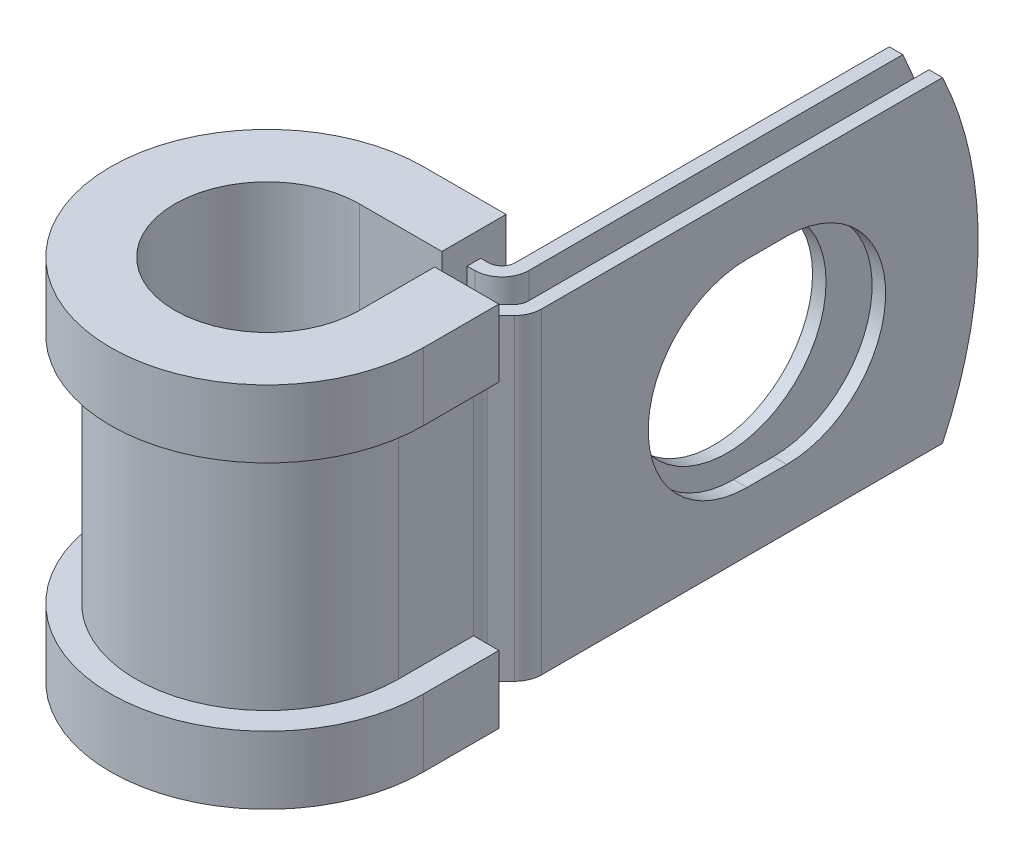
ISO-10303-21;
HEADER;
FILE_DESCRIPTION(('STEP AP214'),'2;1');
FILE_NAME('part.step','',(''),(''),'','','');
FILE_SCHEMA(('AUTOMOTIVE_DESIGN { 1 0 10303 214 1 1 1 1 }'));
ENDSEC;
DATA;
#1=APPLICATION_CONTEXT('core data for automotive mechanical design processes');
#2=APPLICATION_PROTOCOL_DEFINITION('international standard','automotive_design',2000,#1);
#3=PRODUCT_CONTEXT('',#1,'mechanical');
#4=PRODUCT('Part','Part','',(#3));
#5=PRODUCT_RELATED_PRODUCT_CATEGORY('part','',(#4));
#6=PRODUCT_DEFINITION_FORMATION('','',#4);
#7=PRODUCT_DEFINITION_CONTEXT('part definition',#1,'design');
#8=PRODUCT_DEFINITION('design','',#6,#7);
#9=PRODUCT_DEFINITION_SHAPE('','',#8);
#10=(LENGTH_UNIT() NAMED_UNIT(*) SI_UNIT(.MILLI.,.METRE.));
#11=(NAMED_UNIT(*) PLANE_ANGLE_UNIT() SI_UNIT($,.RADIAN.));
#12=(NAMED_UNIT(*) SI_UNIT($,.STERADIAN.) SOLID_ANGLE_UNIT());
#13=UNCERTAINTY_MEASURE_WITH_UNIT(LENGTH_MEASURE(1.E-05),#10,'distance_accuracy_value','');
#14=(GEOMETRIC_REPRESENTATION_CONTEXT(3) GLOBAL_UNCERTAINTY_ASSIGNED_CONTEXT((#13)) GLOBAL_UNIT_ASSIGNED_CONTEXT((#10,
#11,#12)) REPRESENTATION_CONTEXT('',''));
#15=CARTESIAN_POINT('',(0.,0.,0.));
#16=DIRECTION('',(0.,0.,1.));
#17=DIRECTION('',(1.,0.,0.));
#18=AXIS2_PLACEMENT_3D('',#15,#16,#17);
#19=CARTESIAN_POINT('',(7.80147438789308,-9.525,-7.0739));
#20=DIRECTION('',(0.,1.,0.));
#21=DIRECTION('',(1.,0.,0.));
#22=AXIS2_PLACEMENT_3D('',#19,#20,#21);
#23=PLANE('',#22);
#24=DIRECTION('',(0.,0.,-1.));
#25=VECTOR('',#24,1.);
#26=CARTESIAN_POINT('',(4.95667438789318,-9.525,-7.0739));
#27=LINE('',#26,#25);
#28=CARTESIAN_POINT('',(4.95667438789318,-9.525,-7.0739));
#29=VERTEX_POINT('',#28);
#30=CARTESIAN_POINT('',(4.95667438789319,-9.525,-7.8867));
#31=VERTEX_POINT('',#30);
#32=EDGE_CURVE('E505',#29,#31,#27,.T.);
#33=ORIENTED_EDGE('',*,*,#32,.T.);
#34=DIRECTION('',(-1.,0.,0.));
#35=VECTOR('',#34,1.);
#36=CARTESIAN_POINT('',(0.,-9.525,-7.8867));
#37=LINE('',#36,#35);
#38=CARTESIAN_POINT('',(5.41387438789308,-9.525,-7.8867));
#39=VERTEX_POINT('',#38);
#40=EDGE_CURVE('E392',#39,#31,#37,.T.);
#41=ORIENTED_EDGE('',*,*,#40,.F.);
#42=CARTESIAN_POINT('',(5.41387438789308,-9.525,-8.6995));
#43=DIRECTION('',(0.,1.,0.));
#44=DIRECTION('',(1.,0.,0.));
#45=AXIS2_PLACEMENT_3D('',#42,#43,#44);
#46=CIRCLE('',#45,0.8128);
#47=CARTESIAN_POINT('',(6.22667438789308,-9.525,-8.6995));
#48=VERTEX_POINT('',#47);
#49=EDGE_CURVE('E390',#48,#39,#46,.F.);
#50=ORIENTED_EDGE('',*,*,#49,.F.);
#51=DIRECTION('',(0.,0.,-1.));
#52=VECTOR('',#51,1.);
#53=CARTESIAN_POINT('',(6.22667438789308,-9.525,-33.3248));
#54=LINE('',#53,#52);
#55=CARTESIAN_POINT('',(6.22667438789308,-9.525,-31.1802631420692));
#56=VERTEX_POINT('',#55);
#57=EDGE_CURVE('E388',#56,#48,#54,.F.);
#58=ORIENTED_EDGE('',*,*,#57,.F.);
#59=DIRECTION('',(-1.,0.,0.));
#60=VECTOR('',#59,1.);
#61=CARTESIAN_POINT('',(9.42707438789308,-9.525,-31.1802631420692));
#62=LINE('',#61,#60);
#63=CARTESIAN_POINT('',(7.03947438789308,-9.525,-31.1802631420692));
#64=VERTEX_POINT('',#63);
#65=EDGE_CURVE('E11',#64,#56,#62,.T.);
#66=ORIENTED_EDGE('',*,*,#65,.F.);
#67=DIRECTION('',(0.,0.,1.));
#68=VECTOR('',#67,1.);
#69=CARTESIAN_POINT('',(7.03947438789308,-9.525,-33.3248));
#70=LINE('',#69,#68);
#71=CARTESIAN_POINT('',(7.03947438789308,-9.525,-8.6995));
#72=VERTEX_POINT('',#71);
#73=EDGE_CURVE('E386',#64,#72,#70,.T.);
#74=ORIENTED_EDGE('',*,*,#73,.T.);
#75=CARTESIAN_POINT('',(5.41387438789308,-9.525,-8.6995));
#76=DIRECTION('',(0.,-1.,0.));
#77=DIRECTION('',(0.,0.,1.));
#78=AXIS2_PLACEMENT_3D('',#75,#76,#77);
#79=CIRCLE('',#78,1.6256);
#80=CARTESIAN_POINT('',(5.41387438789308,-9.525,-7.0739));
#81=VERTEX_POINT('',#80);
#82=EDGE_CURVE('E383',#72,#81,#79,.T.);
#83=ORIENTED_EDGE('',*,*,#82,.T.);
#84=DIRECTION('',(-1.,0.,0.));
#85=VECTOR('',#84,1.);
#86=CARTESIAN_POINT('',(0.,-9.525,-7.0739));
#87=LINE('',#86,#85);
#88=EDGE_CURVE('E380',#81,#29,#87,.T.);
#89=ORIENTED_EDGE('',*,*,#88,.T.);
#90=EDGE_LOOP('',(#33,#41,#50,#58,#66,#74,#83,#89));
#91=FACE_BOUND('',#90,.T.);
#92=ADVANCED_FACE('F36',(#91),#23,.F.);
#93=CARTESIAN_POINT('',(7.80147438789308,9.525,-7.0739));
#94=DIRECTION('',(0.,1.,0.));
#95=DIRECTION('',(1.,0.,0.));
#96=AXIS2_PLACEMENT_3D('',#93,#94,#95);
#97=PLANE('',#96);
#98=DIRECTION('',(-1.,0.,0.));
#99=VECTOR('',#98,1.);
#100=CARTESIAN_POINT('',(0.,9.525,-7.8867));
#101=LINE('',#100,#99);
#102=CARTESIAN_POINT('',(5.41387438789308,9.525,-7.8867));
#103=VERTEX_POINT('',#102);
#104=CARTESIAN_POINT('',(4.95667438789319,9.525,-7.8867));
#105=VERTEX_POINT('',#104);
#106=EDGE_CURVE('E350',#103,#105,#101,.T.);
#107=ORIENTED_EDGE('',*,*,#106,.T.);
#108=DIRECTION('',(0.,0.,1.));
#109=VECTOR('',#108,1.);
#110=CARTESIAN_POINT('',(4.95667438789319,9.525,-7.8867));
#111=LINE('',#110,#109);
#112=CARTESIAN_POINT('',(4.95667438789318,9.525,-7.0739));
#113=VERTEX_POINT('',#112);
#114=EDGE_CURVE('E499',#105,#113,#111,.T.);
#115=ORIENTED_EDGE('',*,*,#114,.T.);
#116=DIRECTION('',(-1.,0.,0.));
#117=VECTOR('',#116,1.);
#118=CARTESIAN_POINT('',(0.,9.525,-7.0739));
#119=LINE('',#118,#117);
#120=CARTESIAN_POINT('',(5.41387438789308,9.525,-7.0739));
#121=VERTEX_POINT('',#120);
#122=EDGE_CURVE('E607',#121,#113,#119,.T.);
#123=ORIENTED_EDGE('',*,*,#122,.F.);
#124=CARTESIAN_POINT('',(5.41387438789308,9.525,-8.6995));
#125=DIRECTION('',(0.,-1.,0.));
#126=DIRECTION('',(0.,0.,1.));
#127=AXIS2_PLACEMENT_3D('',#124,#125,#126);
#128=CIRCLE('',#127,1.6256);
#129=CARTESIAN_POINT('',(7.03947438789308,9.525,-8.6995));
#130=VERTEX_POINT('',#129);
#131=EDGE_CURVE('E352',#130,#121,#128,.T.);
#132=ORIENTED_EDGE('',*,*,#131,.F.);
#133=DIRECTION('',(0.,0.,1.));
#134=VECTOR('',#133,1.);
#135=CARTESIAN_POINT('',(7.03947438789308,9.525,-33.3248));
#136=LINE('',#135,#134);
#137=CARTESIAN_POINT('',(7.03947438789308,9.525,-31.1802631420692));
#138=VERTEX_POINT('',#137);
#139=EDGE_CURVE('E343',#138,#130,#136,.T.);
#140=ORIENTED_EDGE('',*,*,#139,.F.);
#141=DIRECTION('',(-1.,0.,0.));
#142=VECTOR('',#141,1.);
#143=CARTESIAN_POINT('',(9.42707438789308,9.525,-31.1802631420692));
#144=LINE('',#143,#142);
#145=CARTESIAN_POINT('',(6.22667438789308,9.525,-31.1802631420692));
#146=VERTEX_POINT('',#145);
#147=EDGE_CURVE('E44',#138,#146,#144,.T.);
#148=ORIENTED_EDGE('',*,*,#147,.T.);
#149=DIRECTION('',(0.,0.,-1.));
#150=VECTOR('',#149,1.);
#151=CARTESIAN_POINT('',(6.22667438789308,9.525,-33.3248));
#152=LINE('',#151,#150);
#153=CARTESIAN_POINT('',(6.22667438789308,9.525,-8.6995));
#154=VERTEX_POINT('',#153);
#155=EDGE_CURVE('E340',#146,#154,#152,.F.);
#156=ORIENTED_EDGE('',*,*,#155,.T.);
#157=CARTESIAN_POINT('',(5.41387438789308,9.525,-8.6995));
#158=DIRECTION('',(0.,1.,0.));
#159=DIRECTION('',(1.,0.,0.));
#160=AXIS2_PLACEMENT_3D('',#157,#158,#159);
#161=CIRCLE('',#160,0.8128);
#162=EDGE_CURVE('E348',#154,#103,#161,.F.);
#163=ORIENTED_EDGE('',*,*,#162,.T.);
#164=EDGE_LOOP('',(#107,#115,#123,#132,#140,#148,#156,#163));
#165=FACE_BOUND('',#164,.T.);
#166=ADVANCED_FACE('F339',(#165),#97,.T.);
#167=CARTESIAN_POINT('',(0.,9.525,-7.0739));
#168=DIRECTION('',(0.,0.,1.));
#169=DIRECTION('',(1.,0.,0.));
#170=AXIS2_PLACEMENT_3D('',#167,#168,#169);
#171=PLANE('',#170);
#172=ORIENTED_EDGE('',*,*,#122,.T.);
#173=DIRECTION('',(0.,-1.,0.));
#174=VECTOR('',#173,1.);
#175=CARTESIAN_POINT('',(4.95667438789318,9.525,-7.0739));
#176=LINE('',#175,#174);
#177=EDGE_CURVE('E502',#113,#29,#176,.T.);
#178=ORIENTED_EDGE('',*,*,#177,.T.);
#179=ORIENTED_EDGE('',*,*,#88,.F.);
#180=DIRECTION('',(0.,-1.,0.));
#181=VECTOR('',#180,1.);
#182=CARTESIAN_POINT('',(5.41387438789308,9.525,-7.0739));
#183=LINE('',#182,#181);
#184=EDGE_CURVE('E326',#121,#81,#183,.T.);
#185=ORIENTED_EDGE('',*,*,#184,.F.);
#186=EDGE_LOOP('',(#172,#178,#179,#185));
#187=FACE_BOUND('',#186,.T.);
#188=ADVANCED_FACE('F617',(#187),#171,.T.);
#189=CARTESIAN_POINT('',(9.42707438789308,9.525,-7.0739));
#190=DIRECTION('',(-1.,0.,0.));
#191=DIRECTION('',(0.,0.,1.));
#192=AXIS2_PLACEMENT_3D('',#189,#190,#191);
#193=PLANE('',#192);
#194=CARTESIAN_POINT('',(9.42707438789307,0.,-21.8185999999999));
#195=DIRECTION('',(1.,0.,0.));
#196=DIRECTION('',(0.,0.,-1.));
#197=AXIS2_PLACEMENT_3D('',#194,#195,#196);
#198=CIRCLE('',#197,5.9436);
#199=CARTESIAN_POINT('',(9.42707438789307,-5.9436,-21.8186000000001));
#200=VERTEX_POINT('',#199);
#201=CARTESIAN_POINT('',(9.42707438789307,5.9436,-21.8186000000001));
#202=VERTEX_POINT('',#201);
#203=EDGE_CURVE('E562',#200,#202,#198,.T.);
#204=ORIENTED_EDGE('',*,*,#203,.F.);
#205=DIRECTION('',(0.,0.,-1.));
#206=VECTOR('',#205,1.);
#207=CARTESIAN_POINT('',(9.42707438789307,-5.9436,-19.4309999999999));
#208=LINE('',#207,#206);
#209=CARTESIAN_POINT('',(9.42707438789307,-5.9436,-19.4309999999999));
#210=VERTEX_POINT('',#209);
#211=EDGE_CURVE('E565',#210,#200,#208,.T.);
#212=ORIENTED_EDGE('',*,*,#211,.F.);
#213=CARTESIAN_POINT('',(9.42707438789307,0.,-19.4309999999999));
#214=DIRECTION('',(1.,0.,0.));
#215=DIRECTION('',(0.,0.,-1.));
#216=AXIS2_PLACEMENT_3D('',#213,#214,#215);
#217=CIRCLE('',#216,5.9436);
#218=CARTESIAN_POINT('',(9.42707438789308,5.9436,-19.4309999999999));
#219=VERTEX_POINT('',#218);
#220=EDGE_CURVE('E558',#219,#210,#217,.T.);
#221=ORIENTED_EDGE('',*,*,#220,.F.);
#222=DIRECTION('',(0.,0.,1.));
#223=VECTOR('',#222,1.);
#224=CARTESIAN_POINT('',(9.42707438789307,5.9436,-19.4309999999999));
#225=LINE('',#224,#223);
#226=EDGE_CURVE('E559',#202,#219,#225,.T.);
#227=ORIENTED_EDGE('',*,*,#226,.F.);
#228=EDGE_LOOP('',(#204,#212,#221,#227));
#229=FACE_BOUND('',#228,.T.);
#230=DIRECTION('',(0.,0.,-1.));
#231=VECTOR('',#230,1.);
#232=CARTESIAN_POINT('',(9.42707438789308,-9.525,-7.0739));
#233=LINE('',#232,#231);
#234=CARTESIAN_POINT('',(9.42707438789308,-9.525,-7.0739));
#235=VERTEX_POINT('',#234);
#236=CARTESIAN_POINT('',(9.42707438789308,-9.525,-31.1802631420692));
#237=VERTEX_POINT('',#236);
#238=EDGE_CURVE('E364',#235,#237,#233,.T.);
#239=ORIENTED_EDGE('',*,*,#238,.T.);
#240=CARTESIAN_POINT('',(9.42707438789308,0.,-11.0998));
#241=DIRECTION('',(-1.,0.,0.));
#242=DIRECTION('',(0.,0.,1.));
#243=AXIS2_PLACEMENT_3D('',#240,#241,#242);
#244=CIRCLE('',#243,22.225);
#245=CARTESIAN_POINT('',(9.42707438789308,9.525,-31.1802631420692));
#246=VERTEX_POINT('',#245);
#247=EDGE_CURVE('E550',#246,#237,#244,.T.);
#248=ORIENTED_EDGE('',*,*,#247,.F.);
#249=DIRECTION('',(0.,0.,-1.));
#250=VECTOR('',#249,1.);
#251=CARTESIAN_POINT('',(9.42707438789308,9.525,-7.0739));
#252=LINE('',#251,#250);
#253=CARTESIAN_POINT('',(9.42707438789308,9.525,-7.0739));
#254=VERTEX_POINT('',#253);
#255=EDGE_CURVE('E401',#254,#246,#252,.T.);
#256=ORIENTED_EDGE('',*,*,#255,.F.);
#257=DIRECTION('',(0.,-1.,0.));
#258=VECTOR('',#257,1.);
#259=CARTESIAN_POINT('',(9.42707438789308,9.525,-7.0739));
#260=LINE('',#259,#258);
#261=EDGE_CURVE('E363',#254,#235,#260,.T.);
#262=ORIENTED_EDGE('',*,*,#261,.T.);
#263=EDGE_LOOP('',(#239,#248,#256,#262));
#264=FACE_BOUND('',#263,.T.);
#265=ADVANCED_FACE('F38',(#229,#264),#193,.F.);
#266=CARTESIAN_POINT('',(8.61427438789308,9.525,-7.0739));
#267=DIRECTION('',(-1.,0.,0.));
#268=DIRECTION('',(0.,0.,1.));
#269=AXIS2_PLACEMENT_3D('',#266,#267,#268);
#270=PLANE('',#269);
#271=DIRECTION('',(0.,0.,-1.));
#272=VECTOR('',#271,1.);
#273=CARTESIAN_POINT('',(8.61427438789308,-5.9436,-19.4309999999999));
#274=LINE('',#273,#272);
#275=CARTESIAN_POINT('',(8.61427438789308,-5.9436,-19.4309999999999));
#276=VERTEX_POINT('',#275);
#277=CARTESIAN_POINT('',(8.61427438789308,-5.9436,-21.8186000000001));
#278=VERTEX_POINT('',#277);
#279=EDGE_CURVE('E561',#276,#278,#274,.T.);
#280=ORIENTED_EDGE('',*,*,#279,.T.);
#281=CARTESIAN_POINT('',(8.61427438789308,0.,-21.8185999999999));
#282=DIRECTION('',(-1.,0.,0.));
#283=DIRECTION('',(0.,0.,1.));
#284=AXIS2_PLACEMENT_3D('',#281,#282,#283);
#285=CIRCLE('',#284,5.9436);
#286=CARTESIAN_POINT('',(8.61427438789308,5.9436,-21.8186000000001));
#287=VERTEX_POINT('',#286);
#288=EDGE_CURVE('E582',#278,#287,#285,.F.);
#289=ORIENTED_EDGE('',*,*,#288,.T.);
#290=DIRECTION('',(0.,0.,1.));
#291=VECTOR('',#290,1.);
#292=CARTESIAN_POINT('',(8.61427438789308,5.9436,-19.4309999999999));
#293=LINE('',#292,#291);
#294=CARTESIAN_POINT('',(8.61427438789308,5.9436,-19.4309999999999));
#295=VERTEX_POINT('',#294);
#296=EDGE_CURVE('E578',#287,#295,#293,.T.);
#297=ORIENTED_EDGE('',*,*,#296,.T.);
#298=CARTESIAN_POINT('',(8.61427438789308,0.,-19.4309999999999));
#299=DIRECTION('',(-1.,0.,0.));
#300=DIRECTION('',(0.,0.,1.));
#301=AXIS2_PLACEMENT_3D('',#298,#299,#300);
#302=CIRCLE('',#301,5.9436);
#303=EDGE_CURVE('E573',#295,#276,#302,.F.);
#304=ORIENTED_EDGE('',*,*,#303,.T.);
#305=EDGE_LOOP('',(#280,#289,#297,#304));
#306=FACE_BOUND('',#305,.T.);
#307=CARTESIAN_POINT('',(8.61427438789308,0.,-11.0998));
#308=DIRECTION('',(-1.,0.,0.));
#309=DIRECTION('',(0.,0.,1.));
#310=AXIS2_PLACEMENT_3D('',#307,#308,#309);
#311=CIRCLE('',#310,22.225);
#312=CARTESIAN_POINT('',(8.61427438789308,9.525,-31.1802631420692));
#313=VERTEX_POINT('',#312);
#314=CARTESIAN_POINT('',(8.61427438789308,-9.525,-31.1802631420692));
#315=VERTEX_POINT('',#314);
#316=EDGE_CURVE('E58',#313,#315,#311,.T.);
#317=ORIENTED_EDGE('',*,*,#316,.T.);
#318=DIRECTION('',(0.,0.,-1.));
#319=VECTOR('',#318,1.);
#320=CARTESIAN_POINT('',(8.61427438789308,-9.525,-7.0739));
#321=LINE('',#320,#319);
#322=CARTESIAN_POINT('',(8.61427438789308,-9.525,-7.0739));
#323=VERTEX_POINT('',#322);
#324=EDGE_CURVE('E367',#323,#315,#321,.T.);
#325=ORIENTED_EDGE('',*,*,#324,.F.);
#326=DIRECTION('',(0.,-1.,0.));
#327=VECTOR('',#326,1.);
#328=CARTESIAN_POINT('',(8.61427438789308,9.525,-7.0739));
#329=LINE('',#328,#327);
#330=CARTESIAN_POINT('',(8.61427438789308,9.525,-7.0739));
#331=VERTEX_POINT('',#330);
#332=EDGE_CURVE('E334',#331,#323,#329,.T.);
#333=ORIENTED_EDGE('',*,*,#332,.F.);
#334=DIRECTION('',(0.,0.,-1.));
#335=VECTOR('',#334,1.);
#336=CARTESIAN_POINT('',(8.61427438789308,9.525,-7.0739));
#337=LINE('',#336,#335);
#338=EDGE_CURVE('E597',#331,#313,#337,.T.);
#339=ORIENTED_EDGE('',*,*,#338,.T.);
#340=EDGE_LOOP('',(#317,#325,#333,#339));
#341=FACE_BOUND('',#340,.T.);
#342=ADVANCED_FACE('F671',(#306,#341),#270,.T.);
#343=CARTESIAN_POINT('',(7.03947438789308,9.525,-33.3248));
#344=DIRECTION('',(1.,0.,0.));
#345=DIRECTION('',(0.,0.,-1.));
#346=AXIS2_PLACEMENT_3D('',#343,#344,#345);
#347=PLANE('',#346);
#348=CARTESIAN_POINT('',(7.03947438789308,0.,-20.6248));
#349=DIRECTION('',(1.,0.,0.));
#350=DIRECTION('',(0.,0.,-1.));
#351=AXIS2_PLACEMENT_3D('',#348,#349,#350);
#352=CIRCLE('',#351,5.9436);
#353=CARTESIAN_POINT('',(7.03947438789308,0.,-26.5684));
#354=VERTEX_POINT('',#353);
#355=EDGE_CURVE('E368',#354,#354,#352,.F.);
#356=ORIENTED_EDGE('',*,*,#355,.T.);
#357=EDGE_LOOP('',(#356));
#358=FACE_BOUND('',#357,.T.);
#359=ORIENTED_EDGE('',*,*,#73,.F.);
#360=CARTESIAN_POINT('',(7.03947438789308,0.,-11.0998));
#361=DIRECTION('',(1.,0.,0.));
#362=DIRECTION('',(0.,0.,-1.));
#363=AXIS2_PLACEMENT_3D('',#360,#361,#362);
#364=CIRCLE('',#363,22.225);
#365=EDGE_CURVE('E555',#64,#138,#364,.T.);
#366=ORIENTED_EDGE('',*,*,#365,.T.);
#367=ORIENTED_EDGE('',*,*,#139,.T.);
#368=DIRECTION('',(0.,-1.,0.));
#369=VECTOR('',#368,1.);
#370=CARTESIAN_POINT('',(7.03947438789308,9.525,-8.6995));
#371=LINE('',#370,#369);
#372=EDGE_CURVE('E323',#130,#72,#371,.T.);
#373=ORIENTED_EDGE('',*,*,#372,.T.);
#374=EDGE_LOOP('',(#359,#366,#367,#373));
#375=FACE_BOUND('',#374,.T.);
#376=ADVANCED_FACE('F623',(#358,#375),#347,.T.);
#377=CARTESIAN_POINT('',(6.22667438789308,9.525,-33.3248));
#378=DIRECTION('',(1.,0.,0.));
#379=DIRECTION('',(0.,0.,-1.));
#380=AXIS2_PLACEMENT_3D('',#377,#378,#379);
#381=PLANE('',#380);
#382=CARTESIAN_POINT('',(6.22667438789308,0.,-20.6248));
#383=DIRECTION('',(-1.,0.,0.));
#384=DIRECTION('',(0.,0.,1.));
#385=AXIS2_PLACEMENT_3D('',#382,#383,#384);
#386=CIRCLE('',#385,5.9436);
#387=CARTESIAN_POINT('',(6.22667438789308,0.,-14.6812));
#388=VERTEX_POINT('',#387);
#389=EDGE_CURVE('E590',#388,#388,#386,.T.);
#390=ORIENTED_EDGE('',*,*,#389,.F.);
#391=EDGE_LOOP('',(#390));
#392=FACE_BOUND('',#391,.T.);
#393=CARTESIAN_POINT('',(6.22667438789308,0.,-11.0998));
#394=DIRECTION('',(-1.,0.,0.));
#395=DIRECTION('',(0.,0.,1.));
#396=AXIS2_PLACEMENT_3D('',#393,#394,#395);
#397=CIRCLE('',#396,22.225);
#398=EDGE_CURVE('E50',#146,#56,#397,.T.);
#399=ORIENTED_EDGE('',*,*,#398,.T.);
#400=ORIENTED_EDGE('',*,*,#57,.T.);
#401=DIRECTION('',(0.,-1.,0.));
#402=VECTOR('',#401,1.);
#403=CARTESIAN_POINT('',(6.22667438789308,9.525,-8.6995));
#404=LINE('',#403,#402);
#405=EDGE_CURVE('E320',#154,#48,#404,.T.);
#406=ORIENTED_EDGE('',*,*,#405,.F.);
#407=ORIENTED_EDGE('',*,*,#155,.F.);
#408=EDGE_LOOP('',(#399,#400,#406,#407));
#409=FACE_BOUND('',#408,.T.);
#410=ADVANCED_FACE('F346',(#392,#409),#381,.F.);
#411=CARTESIAN_POINT('',(8.6995,-9.525,-4.52350726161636));
#412=DIRECTION('',(0.,1.,0.));
#413=DIRECTION('',(1.,0.,0.));
#414=AXIS2_PLACEMENT_3D('',#411,#412,#413);
#415=CIRCLE('',#414,0.812799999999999);
#416=CARTESIAN_POINT('',(7.8867,-9.525,-4.52350726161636));
#417=VERTEX_POINT('',#416);
#418=CARTESIAN_POINT('',(8.12476360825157,-9.525,-5.09824365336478));
#419=VERTEX_POINT('',#418);
#420=EDGE_CURVE('E395',#417,#419,#415,.F.);
#421=ORIENTED_EDGE('',*,*,#420,.F.);
#422=DIRECTION('',(1.,0.,0.));
#423=VECTOR('',#422,1.);
#424=CARTESIAN_POINT('',(7.0739,-9.525,-4.52350726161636));
#425=LINE('',#424,#423);
#426=CARTESIAN_POINT('',(7.0739,-9.525,-4.52350726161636));
#427=VERTEX_POINT('',#426);
#428=EDGE_CURVE('E433',#427,#417,#425,.T.);
#429=ORIENTED_EDGE('',*,*,#428,.F.);
#430=CARTESIAN_POINT('',(8.6995,-9.525,-4.52350726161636));
#431=DIRECTION('',(0.,-1.,0.));
#432=DIRECTION('',(0.,0.,1.));
#433=AXIS2_PLACEMENT_3D('',#430,#431,#432);
#434=CIRCLE('',#433,1.6256);
#435=CARTESIAN_POINT('',(7.55002721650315,-9.525,-5.67298004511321));
#436=VERTEX_POINT('',#435);
#437=EDGE_CURVE('E377',#427,#436,#434,.T.);
#438=ORIENTED_EDGE('',*,*,#437,.T.);
#439=DIRECTION('',(0.707106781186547,0.,-0.707106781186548));
#440=VECTOR('',#439,1.);
#441=CARTESIAN_POINT('',(7.55002721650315,-9.525,-5.67298004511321));
#442=LINE('',#441,#440);
#443=CARTESIAN_POINT('',(8.37621077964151,-9.525,-6.49916360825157));
#444=VERTEX_POINT('',#443);
#445=EDGE_CURVE('E374',#436,#444,#442,.T.);
#446=ORIENTED_EDGE('',*,*,#445,.T.);
#447=CARTESIAN_POINT('',(7.80147438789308,-9.525,-7.0739));
#448=DIRECTION('',(0.,1.,0.));
#449=DIRECTION('',(0.,0.,1.));
#450=AXIS2_PLACEMENT_3D('',#447,#448,#449);
#451=CIRCLE('',#450,0.812800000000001);
#452=EDGE_CURVE('E371',#444,#323,#451,.T.);
#453=ORIENTED_EDGE('',*,*,#452,.T.);
#454=ORIENTED_EDGE('',*,*,#324,.T.);
#455=DIRECTION('',(-1.,0.,0.));
#456=VECTOR('',#455,1.);
#457=CARTESIAN_POINT('',(9.42707438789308,-9.525,-31.1802631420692));
#458=LINE('',#457,#456);
#459=EDGE_CURVE('E548',#237,#315,#458,.T.);
#460=ORIENTED_EDGE('',*,*,#459,.F.);
#461=ORIENTED_EDGE('',*,*,#238,.F.);
#462=CARTESIAN_POINT('',(7.80147438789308,-9.525,-7.0739));
#463=DIRECTION('',(0.,1.,0.));
#464=DIRECTION('',(1.,0.,0.));
#465=AXIS2_PLACEMENT_3D('',#462,#463,#464);
#466=CIRCLE('',#465,1.6256);
#467=CARTESIAN_POINT('',(8.95094717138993,-9.525,-5.92442721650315));
#468=VERTEX_POINT('',#467);
#469=EDGE_CURVE('E399',#468,#235,#466,.T.);
#470=ORIENTED_EDGE('',*,*,#469,.F.);
#471=DIRECTION('',(0.707106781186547,0.,-0.707106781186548));
#472=VECTOR('',#471,1.);
#473=CARTESIAN_POINT('',(8.12476360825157,-9.525,-5.09824365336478));
#474=LINE('',#473,#472);
#475=EDGE_CURVE('E397',#419,#468,#474,.T.);
#476=ORIENTED_EDGE('',*,*,#475,.F.);
#477=EDGE_LOOP('',(#421,#429,#438,#446,#453,#454,#460,#461,#470,#476));
#478=FACE_BOUND('',#477,.T.);
#479=ADVANCED_FACE('F657',(#478),#23,.F.);
#480=DIRECTION('',(-1.,0.,0.));
#481=VECTOR('',#480,1.);
#482=CARTESIAN_POINT('',(7.8867,9.525,-4.52350726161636));
#483=LINE('',#482,#481);
#484=CARTESIAN_POINT('',(7.8867,9.525,-4.52350726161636));
#485=VERTEX_POINT('',#484);
#486=CARTESIAN_POINT('',(7.0739,9.525,-4.52350726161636));
#487=VERTEX_POINT('',#486);
#488=EDGE_CURVE('E422',#485,#487,#483,.T.);
#489=ORIENTED_EDGE('',*,*,#488,.F.);
#490=CARTESIAN_POINT('',(8.6995,9.525,-4.52350726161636));
#491=DIRECTION('',(0.,1.,0.));
#492=DIRECTION('',(1.,0.,0.));
#493=AXIS2_PLACEMENT_3D('',#490,#491,#492);
#494=CIRCLE('',#493,0.812799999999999);
#495=CARTESIAN_POINT('',(8.12476360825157,9.525,-5.09824365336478));
#496=VERTEX_POINT('',#495);
#497=EDGE_CURVE('E357',#485,#496,#494,.F.);
#498=ORIENTED_EDGE('',*,*,#497,.T.);
#499=DIRECTION('',(0.707106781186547,0.,-0.707106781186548));
#500=VECTOR('',#499,1.);
#501=CARTESIAN_POINT('',(8.12476360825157,9.525,-5.09824365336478));
#502=LINE('',#501,#500);
#503=CARTESIAN_POINT('',(8.95094717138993,9.525,-5.92442721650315));
#504=VERTEX_POINT('',#503);
#505=EDGE_CURVE('E359',#496,#504,#502,.T.);
#506=ORIENTED_EDGE('',*,*,#505,.T.);
#507=CARTESIAN_POINT('',(7.80147438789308,9.525,-7.0739));
#508=DIRECTION('',(0.,1.,0.));
#509=DIRECTION('',(1.,0.,0.));
#510=AXIS2_PLACEMENT_3D('',#507,#508,#509);
#511=CIRCLE('',#510,1.6256);
#512=EDGE_CURVE('E361',#504,#254,#511,.T.);
#513=ORIENTED_EDGE('',*,*,#512,.T.);
#514=ORIENTED_EDGE('',*,*,#255,.T.);
#515=DIRECTION('',(-1.,0.,0.));
#516=VECTOR('',#515,1.);
#517=CARTESIAN_POINT('',(9.42707438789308,9.525,-31.1802631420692));
#518=LINE('',#517,#516);
#519=EDGE_CURVE('E552',#246,#313,#518,.T.);
#520=ORIENTED_EDGE('',*,*,#519,.T.);
#521=ORIENTED_EDGE('',*,*,#338,.F.);
#522=CARTESIAN_POINT('',(7.80147438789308,9.525,-7.0739));
#523=DIRECTION('',(0.,1.,0.));
#524=DIRECTION('',(0.,0.,1.));
#525=AXIS2_PLACEMENT_3D('',#522,#523,#524);
#526=CIRCLE('',#525,0.812800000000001);
#527=CARTESIAN_POINT('',(8.37621077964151,9.525,-6.49916360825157));
#528=VERTEX_POINT('',#527);
#529=EDGE_CURVE('E600',#528,#331,#526,.T.);
#530=ORIENTED_EDGE('',*,*,#529,.F.);
#531=DIRECTION('',(0.707106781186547,0.,-0.707106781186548));
#532=VECTOR('',#531,1.);
#533=CARTESIAN_POINT('',(7.55002721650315,9.525,-5.67298004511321));
#534=LINE('',#533,#532);
#535=CARTESIAN_POINT('',(7.55002721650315,9.525,-5.67298004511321));
#536=VERTEX_POINT('',#535);
#537=EDGE_CURVE('E603',#536,#528,#534,.T.);
#538=ORIENTED_EDGE('',*,*,#537,.F.);
#539=CARTESIAN_POINT('',(8.6995,9.525,-4.52350726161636));
#540=DIRECTION('',(0.,-1.,0.));
#541=DIRECTION('',(0.,0.,1.));
#542=AXIS2_PLACEMENT_3D('',#539,#540,#541);
#543=CIRCLE('',#542,1.6256);
#544=EDGE_CURVE('E432',#487,#536,#543,.T.);
#545=ORIENTED_EDGE('',*,*,#544,.F.);
#546=EDGE_LOOP('',(#489,#498,#506,#513,#514,#520,#521,#530,#538,#545));
#547=FACE_BOUND('',#546,.T.);
#548=ADVANCED_FACE('F429',(#547),#97,.T.);
#549=CARTESIAN_POINT('',(7.80147438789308,9.525,-7.0739));
#550=DIRECTION('',(0.,-1.,0.));
#551=DIRECTION('',(0.,0.,-1.));
#552=AXIS2_PLACEMENT_3D('',#549,#550,#551);
#553=CYLINDRICAL_SURFACE('',#552,0.812800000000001);
#554=ORIENTED_EDGE('',*,*,#452,.F.);
#555=DIRECTION('',(0.,-1.,0.));
#556=VECTOR('',#555,1.);
#557=CARTESIAN_POINT('',(8.37621077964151,9.525,-6.49916360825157));
#558=LINE('',#557,#556);
#559=EDGE_CURVE('E332',#528,#444,#558,.T.);
#560=ORIENTED_EDGE('',*,*,#559,.F.);
#561=ORIENTED_EDGE('',*,*,#529,.T.);
#562=ORIENTED_EDGE('',*,*,#332,.T.);
#563=EDGE_LOOP('',(#554,#560,#561,#562));
#564=FACE_BOUND('',#563,.T.);
#565=ADVANCED_FACE('F667',(#564),#553,.F.);
#566=CARTESIAN_POINT('',(7.55002721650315,9.525,-5.67298004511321));
#567=DIRECTION('',(-0.707106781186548,0.,-0.707106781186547));
#568=DIRECTION('',(-0.707106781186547,0.,0.707106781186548));
#569=AXIS2_PLACEMENT_3D('',#566,#567,#568);
#570=PLANE('',#569);
#571=ORIENTED_EDGE('',*,*,#445,.F.);
#572=DIRECTION('',(0.,-1.,0.));
#573=VECTOR('',#572,1.);
#574=CARTESIAN_POINT('',(7.55002721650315,9.525,-5.67298004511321));
#575=LINE('',#574,#573);
#576=EDGE_CURVE('E330',#536,#436,#575,.T.);
#577=ORIENTED_EDGE('',*,*,#576,.F.);
#578=ORIENTED_EDGE('',*,*,#537,.T.);
#579=ORIENTED_EDGE('',*,*,#559,.T.);
#580=EDGE_LOOP('',(#571,#577,#578,#579));
#581=FACE_BOUND('',#580,.T.);
#582=ADVANCED_FACE('F662',(#581),#570,.T.);
#583=CARTESIAN_POINT('',(8.6995,9.525,-4.52350726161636));
#584=DIRECTION('',(0.,-1.,0.));
#585=DIRECTION('',(0.,0.,-1.));
#586=AXIS2_PLACEMENT_3D('',#583,#584,#585);
#587=CYLINDRICAL_SURFACE('',#586,1.6256);
#588=ORIENTED_EDGE('',*,*,#437,.F.);
#589=DIRECTION('',(0.,-1.,0.));
#590=VECTOR('',#589,1.);
#591=CARTESIAN_POINT('',(7.0739,9.525,-4.52350726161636));
#592=LINE('',#591,#590);
#593=EDGE_CURVE('E328',#487,#427,#592,.T.);
#594=ORIENTED_EDGE('',*,*,#593,.F.);
#595=ORIENTED_EDGE('',*,*,#544,.T.);
#596=ORIENTED_EDGE('',*,*,#576,.T.);
#597=EDGE_LOOP('',(#588,#594,#595,#596));
#598=FACE_BOUND('',#597,.T.);
#599=ADVANCED_FACE('F659',(#598),#587,.T.);
#600=CARTESIAN_POINT('',(5.41387438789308,9.525,-8.6995));
#601=DIRECTION('',(0.,-1.,0.));
#602=DIRECTION('',(0.,0.,-1.));
#603=AXIS2_PLACEMENT_3D('',#600,#601,#602);
#604=CYLINDRICAL_SURFACE('',#603,1.6256);
#605=ORIENTED_EDGE('',*,*,#82,.F.);
#606=ORIENTED_EDGE('',*,*,#372,.F.);
#607=ORIENTED_EDGE('',*,*,#131,.T.);
#608=ORIENTED_EDGE('',*,*,#184,.T.);
#609=EDGE_LOOP('',(#605,#606,#607,#608));
#610=FACE_BOUND('',#609,.T.);
#611=ADVANCED_FACE('F613',(#610),#604,.T.);
#612=CARTESIAN_POINT('',(5.41387438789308,9.525,-8.6995));
#613=DIRECTION('',(0.,-1.,0.));
#614=DIRECTION('',(0.,0.,-1.));
#615=AXIS2_PLACEMENT_3D('',#612,#613,#614);
#616=CYLINDRICAL_SURFACE('',#615,0.8128);
#617=ORIENTED_EDGE('',*,*,#49,.T.);
#618=DIRECTION('',(0.,-1.,0.));
#619=VECTOR('',#618,1.);
#620=CARTESIAN_POINT('',(5.41387438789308,9.525,-7.8867));
#621=LINE('',#620,#619);
#622=EDGE_CURVE('E311',#103,#39,#621,.T.);
#623=ORIENTED_EDGE('',*,*,#622,.F.);
#624=ORIENTED_EDGE('',*,*,#162,.F.);
#625=ORIENTED_EDGE('',*,*,#405,.T.);
#626=EDGE_LOOP('',(#617,#623,#624,#625));
#627=FACE_BOUND('',#626,.T.);
#628=ADVANCED_FACE('F628',(#627),#616,.F.);
#629=CARTESIAN_POINT('',(0.,9.525,-7.8867));
#630=DIRECTION('',(0.,0.,1.));
#631=DIRECTION('',(1.,0.,0.));
#632=AXIS2_PLACEMENT_3D('',#629,#630,#631);
#633=PLANE('',#632);
#634=DIRECTION('',(0.,-1.,0.));
#635=VECTOR('',#634,1.);
#636=CARTESIAN_POINT('',(0.,9.525,-7.8867));
#637=LINE('',#636,#635);
#638=CARTESIAN_POINT('',(1.10627984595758E-13,6.985,-7.8867));
#639=VERTEX_POINT('',#638);
#640=CARTESIAN_POINT('',(1.10627984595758E-13,-6.985,-7.8867));
#641=VERTEX_POINT('',#640);
#642=EDGE_CURVE('E302',#639,#641,#637,.T.);
#643=ORIENTED_EDGE('',*,*,#642,.F.);
#644=DIRECTION('',(1.,0.,0.));
#645=VECTOR('',#644,1.);
#646=CARTESIAN_POINT('',(1.10627984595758E-13,6.985,-7.8867));
#647=LINE('',#646,#645);
#648=CARTESIAN_POINT('',(4.95667438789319,6.985,-7.8867));
#649=VERTEX_POINT('',#648);
#650=EDGE_CURVE('E545',#639,#649,#647,.T.);
#651=ORIENTED_EDGE('',*,*,#650,.T.);
#652=DIRECTION('',(0.,1.,0.));
#653=VECTOR('',#652,1.);
#654=CARTESIAN_POINT('',(4.95667438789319,9.525,-7.8867));
#655=LINE('',#654,#653);
#656=EDGE_CURVE('E496',#649,#105,#655,.T.);
#657=ORIENTED_EDGE('',*,*,#656,.T.);
#658=ORIENTED_EDGE('',*,*,#106,.F.);
#659=ORIENTED_EDGE('',*,*,#622,.T.);
#660=ORIENTED_EDGE('',*,*,#40,.T.);
#661=DIRECTION('',(0.,1.,0.));
#662=VECTOR('',#661,1.);
#663=CARTESIAN_POINT('',(4.95667438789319,-9.525,-7.8867));
#664=LINE('',#663,#662);
#665=CARTESIAN_POINT('',(4.95667438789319,-6.985,-7.8867));
#666=VERTEX_POINT('',#665);
#667=EDGE_CURVE('E508',#31,#666,#664,.T.);
#668=ORIENTED_EDGE('',*,*,#667,.T.);
#669=DIRECTION('',(1.,0.,0.));
#670=VECTOR('',#669,1.);
#671=CARTESIAN_POINT('',(1.10627984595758E-13,-6.985,-7.8867));
#672=LINE('',#671,#670);
#673=EDGE_CURVE('E525',#641,#666,#672,.T.);
#674=ORIENTED_EDGE('',*,*,#673,.F.);
#675=EDGE_LOOP('',(#643,#651,#657,#658,#659,#660,#668,#674));
#676=FACE_BOUND('',#675,.T.);
#677=ADVANCED_FACE('F632',(#676),#633,.F.);
#678=CARTESIAN_POINT('',(0.,9.525,0.));
#679=DIRECTION('',(0.,-1.,0.));
#680=DIRECTION('',(0.,0.,-1.));
#681=AXIS2_PLACEMENT_3D('',#678,#679,#680);
#682=CYLINDRICAL_SURFACE('',#681,7.8867);
#683=DIRECTION('',(0.,-1.,0.));
#684=VECTOR('',#683,1.);
#685=CARTESIAN_POINT('',(7.8867,9.525,0.));
#686=LINE('',#685,#684);
#687=CARTESIAN_POINT('',(7.8867,6.985,0.));
#688=VERTEX_POINT('',#687);
#689=CARTESIAN_POINT('',(7.8867,-6.985,0.));
#690=VERTEX_POINT('',#689);
#691=EDGE_CURVE('E300',#688,#690,#686,.T.);
#692=ORIENTED_EDGE('',*,*,#691,.F.);
#693=CARTESIAN_POINT('',(0.,6.985,0.));
#694=DIRECTION('',(0.,-1.,0.));
#695=DIRECTION('',(0.,0.,-1.));
#696=AXIS2_PLACEMENT_3D('',#693,#694,#695);
#697=CIRCLE('',#696,7.8867);
#698=EDGE_CURVE('E494',#688,#639,#697,.T.);
#699=ORIENTED_EDGE('',*,*,#698,.T.);
#700=ORIENTED_EDGE('',*,*,#642,.T.);
#701=CARTESIAN_POINT('',(0.,-6.985,0.));
#702=DIRECTION('',(0.,-1.,0.));
#703=DIRECTION('',(0.,0.,-1.));
#704=AXIS2_PLACEMENT_3D('',#701,#702,#703);
#705=CIRCLE('',#704,7.8867);
#706=EDGE_CURVE('E283',#690,#641,#705,.T.);
#707=ORIENTED_EDGE('',*,*,#706,.F.);
#708=EDGE_LOOP('',(#692,#699,#700,#707));
#709=FACE_BOUND('',#708,.T.);
#710=ADVANCED_FACE('F298',(#709),#682,.T.);
#711=CARTESIAN_POINT('',(7.8867,9.525,0.));
#712=DIRECTION('',(-1.,0.,0.));
#713=DIRECTION('',(0.,0.,1.));
#714=AXIS2_PLACEMENT_3D('',#711,#712,#713);
#715=PLANE('',#714);
#716=DIRECTION('',(0.,-1.,0.));
#717=VECTOR('',#716,1.);
#718=CARTESIAN_POINT('',(7.8867,9.525,-4.52350726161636));
#719=LINE('',#718,#717);
#720=CARTESIAN_POINT('',(7.8867,6.985,-4.52350726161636));
#721=VERTEX_POINT('',#720);
#722=CARTESIAN_POINT('',(7.8867,-6.985,-4.52350726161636));
#723=VERTEX_POINT('',#722);
#724=EDGE_CURVE('E314',#721,#723,#719,.T.);
#725=ORIENTED_EDGE('',*,*,#724,.F.);
#726=DIRECTION('',(0.,0.,-1.));
#727=VECTOR('',#726,1.);
#728=CARTESIAN_POINT('',(7.8867,6.985,0.));
#729=LINE('',#728,#727);
#730=EDGE_CURVE('E308',#688,#721,#729,.T.);
#731=ORIENTED_EDGE('',*,*,#730,.F.);
#732=ORIENTED_EDGE('',*,*,#691,.T.);
#733=DIRECTION('',(0.,0.,-1.));
#734=VECTOR('',#733,1.);
#735=CARTESIAN_POINT('',(7.8867,-6.985,0.));
#736=LINE('',#735,#734);
#737=EDGE_CURVE('E279',#690,#723,#736,.T.);
#738=ORIENTED_EDGE('',*,*,#737,.T.);
#739=EDGE_LOOP('',(#725,#731,#732,#738));
#740=FACE_BOUND('',#739,.T.);
#741=ADVANCED_FACE('F307',(#740),#715,.F.);
#742=CARTESIAN_POINT('',(8.6995,9.525,-4.52350726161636));
#743=DIRECTION('',(0.,-1.,0.));
#744=DIRECTION('',(0.,0.,-1.));
#745=AXIS2_PLACEMENT_3D('',#742,#743,#744);
#746=CYLINDRICAL_SURFACE('',#745,0.812799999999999);
#747=ORIENTED_EDGE('',*,*,#420,.T.);
#748=DIRECTION('',(0.,-1.,0.));
#749=VECTOR('',#748,1.);
#750=CARTESIAN_POINT('',(8.12476360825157,9.525,-5.09824365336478));
#751=LINE('',#750,#749);
#752=EDGE_CURVE('E406',#496,#419,#751,.T.);
#753=ORIENTED_EDGE('',*,*,#752,.F.);
#754=ORIENTED_EDGE('',*,*,#497,.F.);
#755=EDGE_CURVE('E309',#485,#721,#719,.T.);
#756=ORIENTED_EDGE('',*,*,#755,.T.);
#757=ORIENTED_EDGE('',*,*,#724,.T.);
#758=DIRECTION('',(0.,1.,0.));
#759=VECTOR('',#758,1.);
#760=CARTESIAN_POINT('',(7.8867,-9.525,-4.52350726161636));
#761=LINE('',#760,#759);
#762=EDGE_CURVE('E415',#417,#723,#761,.T.);
#763=ORIENTED_EDGE('',*,*,#762,.F.);
#764=EDGE_LOOP('',(#747,#753,#754,#756,#757,#763));
#765=FACE_BOUND('',#764,.T.);
#766=ADVANCED_FACE('F414',(#765),#746,.F.);
#767=CARTESIAN_POINT('',(8.12476360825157,9.525,-5.09824365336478));
#768=DIRECTION('',(-0.707106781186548,0.,-0.707106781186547));
#769=DIRECTION('',(-0.707106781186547,0.,0.707106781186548));
#770=AXIS2_PLACEMENT_3D('',#767,#768,#769);
#771=PLANE('',#770);
#772=ORIENTED_EDGE('',*,*,#475,.T.);
#773=DIRECTION('',(0.,-1.,0.));
#774=VECTOR('',#773,1.);
#775=CARTESIAN_POINT('',(8.95094717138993,9.525,-5.92442721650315));
#776=LINE('',#775,#774);
#777=EDGE_CURVE('E404',#504,#468,#776,.T.);
#778=ORIENTED_EDGE('',*,*,#777,.F.);
#779=ORIENTED_EDGE('',*,*,#505,.F.);
#780=ORIENTED_EDGE('',*,*,#752,.T.);
#781=EDGE_LOOP('',(#772,#778,#779,#780));
#782=FACE_BOUND('',#781,.T.);
#783=ADVANCED_FACE('F683',(#782),#771,.F.);
#784=CARTESIAN_POINT('',(7.80147438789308,9.525,-7.0739));
#785=DIRECTION('',(0.,-1.,0.));
#786=DIRECTION('',(0.,0.,-1.));
#787=AXIS2_PLACEMENT_3D('',#784,#785,#786);
#788=CYLINDRICAL_SURFACE('',#787,1.6256);
#789=ORIENTED_EDGE('',*,*,#469,.T.);
#790=ORIENTED_EDGE('',*,*,#261,.F.);
#791=ORIENTED_EDGE('',*,*,#512,.F.);
#792=ORIENTED_EDGE('',*,*,#777,.T.);
#793=EDGE_LOOP('',(#789,#790,#791,#792));
#794=FACE_BOUND('',#793,.T.);
#795=ADVANCED_FACE('F681',(#794),#788,.T.);
#796=CARTESIAN_POINT('',(23.8505138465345,0.,-20.6248));
#797=DIRECTION('',(-1.,0.,0.));
#798=DIRECTION('',(0.,0.,1.));
#799=AXIS2_PLACEMENT_3D('',#796,#797,#798);
#800=CYLINDRICAL_SURFACE('',#799,5.9436);
#801=ORIENTED_EDGE('',*,*,#389,.T.);
#802=EDGE_LOOP('',(#801));
#803=FACE_BOUND('',#802,.T.);
#804=ORIENTED_EDGE('',*,*,#355,.F.);
#805=EDGE_LOOP('',(#804));
#806=FACE_BOUND('',#805,.T.);
#807=ADVANCED_FACE('F690',(#803,#806),#800,.F.);
#808=CARTESIAN_POINT('',(-9.96193186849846,-5.9436,-19.4309999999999));
#809=DIRECTION('',(0.,-1.,0.));
#810=DIRECTION('',(0.,0.,-1.));
#811=AXIS2_PLACEMENT_3D('',#808,#809,#810);
#812=PLANE('',#811);
#813=DIRECTION('',(1.,0.,0.));
#814=VECTOR('',#813,1.);
#815=CARTESIAN_POINT('',(-9.96193186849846,-5.9436,-19.4309999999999));
#816=LINE('',#815,#814);
#817=EDGE_CURVE('E576',#276,#210,#816,.T.);
#818=ORIENTED_EDGE('',*,*,#817,.T.);
#819=ORIENTED_EDGE('',*,*,#211,.T.);
#820=DIRECTION('',(1.,0.,0.));
#821=VECTOR('',#820,1.);
#822=CARTESIAN_POINT('',(-9.96193186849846,-5.9436,-21.8186000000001));
#823=LINE('',#822,#821);
#824=EDGE_CURVE('E572',#278,#200,#823,.T.);
#825=ORIENTED_EDGE('',*,*,#824,.F.);
#826=ORIENTED_EDGE('',*,*,#279,.F.);
#827=EDGE_LOOP('',(#818,#819,#825,#826));
#828=FACE_BOUND('',#827,.T.);
#829=ADVANCED_FACE('F733',(#828),#812,.F.);
#830=CARTESIAN_POINT('',(-9.96193186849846,0.,-21.8185999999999));
#831=DIRECTION('',(1.,0.,0.));
#832=DIRECTION('',(0.,0.,-1.));
#833=AXIS2_PLACEMENT_3D('',#830,#831,#832);
#834=CYLINDRICAL_SURFACE('',#833,5.9436);
#835=ORIENTED_EDGE('',*,*,#824,.T.);
#836=ORIENTED_EDGE('',*,*,#203,.T.);
#837=DIRECTION('',(1.,0.,0.));
#838=VECTOR('',#837,1.);
#839=CARTESIAN_POINT('',(-9.96193186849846,5.9436,-21.8186000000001));
#840=LINE('',#839,#838);
#841=EDGE_CURVE('E581',#287,#202,#840,.T.);
#842=ORIENTED_EDGE('',*,*,#841,.F.);
#843=ORIENTED_EDGE('',*,*,#288,.F.);
#844=EDGE_LOOP('',(#835,#836,#842,#843));
#845=FACE_BOUND('',#844,.T.);
#846=ADVANCED_FACE('F737',(#845),#834,.F.);
#847=CARTESIAN_POINT('',(-9.96193186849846,5.9436,-19.4309999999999));
#848=DIRECTION('',(0.,1.,0.));
#849=DIRECTION('',(0.,0.,1.));
#850=AXIS2_PLACEMENT_3D('',#847,#848,#849);
#851=PLANE('',#850);
#852=ORIENTED_EDGE('',*,*,#841,.T.);
#853=ORIENTED_EDGE('',*,*,#226,.T.);
#854=DIRECTION('',(1.,0.,0.));
#855=VECTOR('',#854,1.);
#856=CARTESIAN_POINT('',(-9.96193186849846,5.9436,-19.4309999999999));
#857=LINE('',#856,#855);
#858=EDGE_CURVE('E577',#295,#219,#857,.T.);
#859=ORIENTED_EDGE('',*,*,#858,.F.);
#860=ORIENTED_EDGE('',*,*,#296,.F.);
#861=EDGE_LOOP('',(#852,#853,#859,#860));
#862=FACE_BOUND('',#861,.T.);
#863=ADVANCED_FACE('F741',(#862),#851,.F.);
#864=CARTESIAN_POINT('',(-9.96193186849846,0.,-19.4309999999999));
#865=DIRECTION('',(1.,0.,0.));
#866=DIRECTION('',(0.,0.,-1.));
#867=AXIS2_PLACEMENT_3D('',#864,#865,#866);
#868=CYLINDRICAL_SURFACE('',#867,5.9436);
#869=ORIENTED_EDGE('',*,*,#858,.T.);
#870=ORIENTED_EDGE('',*,*,#220,.T.);
#871=ORIENTED_EDGE('',*,*,#817,.F.);
#872=ORIENTED_EDGE('',*,*,#303,.F.);
#873=EDGE_LOOP('',(#869,#870,#871,#872));
#874=FACE_BOUND('',#873,.T.);
#875=ADVANCED_FACE('F745',(#874),#868,.F.);
#876=CARTESIAN_POINT('',(9.42707438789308,0.,-11.0998));
#877=DIRECTION('',(-1.,0.,0.));
#878=DIRECTION('',(0.,0.,1.));
#879=AXIS2_PLACEMENT_3D('',#876,#877,#878);
#880=CYLINDRICAL_SURFACE('',#879,22.225);
#881=ORIENTED_EDGE('',*,*,#365,.F.);
#882=ORIENTED_EDGE('',*,*,#65,.T.);
#883=ORIENTED_EDGE('',*,*,#398,.F.);
#884=ORIENTED_EDGE('',*,*,#147,.F.);
#885=EDGE_LOOP('',(#881,#882,#883,#884));
#886=FACE_BOUND('',#885,.T.);
#887=ADVANCED_FACE('F624',(#886),#880,.T.);
#888=ORIENTED_EDGE('',*,*,#519,.F.);
#889=ORIENTED_EDGE('',*,*,#247,.T.);
#890=ORIENTED_EDGE('',*,*,#459,.T.);
#891=ORIENTED_EDGE('',*,*,#316,.F.);
#892=EDGE_LOOP('',(#888,#889,#890,#891));
#893=FACE_BOUND('',#892,.T.);
#894=ADVANCED_FACE('F672',(#893),#880,.T.);
#895=CARTESIAN_POINT('',(1.32005372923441E-13,11.049,-9.4107));
#896=DIRECTION('',(0.,0.,1.));
#897=DIRECTION('',(1.,0.,0.));
#898=AXIS2_PLACEMENT_3D('',#895,#896,#897);
#899=PLANE('',#898);
#900=DIRECTION('',(0.,-1.,0.));
#901=VECTOR('',#900,1.);
#902=CARTESIAN_POINT('',(1.32005372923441E-13,11.049,-9.4107));
#903=LINE('',#902,#901);
#904=CARTESIAN_POINT('',(1.32005372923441E-13,11.049,-9.4107));
#905=VERTEX_POINT('',#904);
#906=CARTESIAN_POINT('',(1.32005372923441E-13,6.985,-9.4107));
#907=VERTEX_POINT('',#906);
#908=EDGE_CURVE('E304',#905,#907,#903,.T.);
#909=ORIENTED_EDGE('',*,*,#908,.F.);
#910=DIRECTION('',(1.,0.,0.));
#911=VECTOR('',#910,1.);
#912=CARTESIAN_POINT('',(1.32005372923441E-13,11.049,-9.4107));
#913=LINE('',#912,#911);
#914=CARTESIAN_POINT('',(4.95667438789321,11.049,-9.4107));
#915=VERTEX_POINT('',#914);
#916=EDGE_CURVE('E539',#905,#915,#913,.T.);
#917=ORIENTED_EDGE('',*,*,#916,.T.);
#918=DIRECTION('',(0.,-1.,0.));
#919=VECTOR('',#918,1.);
#920=CARTESIAN_POINT('',(4.95667438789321,11.049,-9.4107));
#921=LINE('',#920,#919);
#922=CARTESIAN_POINT('',(4.95667438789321,6.985,-9.4107));
#923=VERTEX_POINT('',#922);
#924=EDGE_CURVE('E521',#915,#923,#921,.T.);
#925=ORIENTED_EDGE('',*,*,#924,.T.);
#926=DIRECTION('',(1.,0.,0.));
#927=VECTOR('',#926,1.);
#928=CARTESIAN_POINT('',(1.32005372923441E-13,6.985,-9.4107));
#929=LINE('',#928,#927);
#930=EDGE_CURVE('E542',#907,#923,#929,.T.);
#931=ORIENTED_EDGE('',*,*,#930,.F.);
#932=EDGE_LOOP('',(#909,#917,#925,#931));
#933=FACE_BOUND('',#932,.T.);
#934=ADVANCED_FACE('F836',(#933),#899,.F.);
#935=CARTESIAN_POINT('',(0.,11.049,-5.5499));
#936=DIRECTION('',(0.,0.,-1.));
#937=DIRECTION('',(0.,1.,0.));
#938=AXIS2_PLACEMENT_3D('',#935,#936,#937);
#939=PLANE('',#938);
#940=DIRECTION('',(0.,1.,0.));
#941=VECTOR('',#940,1.);
#942=CARTESIAN_POINT('',(0.,11.049,-5.5499));
#943=LINE('',#942,#941);
#944=CARTESIAN_POINT('',(0.,-11.049,-5.5499));
#945=VERTEX_POINT('',#944);
#946=CARTESIAN_POINT('',(0.,11.049,-5.5499));
#947=VERTEX_POINT('',#946);
#948=EDGE_CURVE('E472',#945,#947,#943,.T.);
#949=ORIENTED_EDGE('',*,*,#948,.F.);
#950=DIRECTION('',(1.,0.,0.));
#951=VECTOR('',#950,1.);
#952=CARTESIAN_POINT('',(0.,-11.049,-5.5499));
#953=LINE('',#952,#951);
#954=CARTESIAN_POINT('',(4.95667438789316,-11.049,-5.5499));
#955=VERTEX_POINT('',#954);
#956=EDGE_CURVE('E533',#945,#955,#953,.T.);
#957=ORIENTED_EDGE('',*,*,#956,.T.);
#958=DIRECTION('',(0.,1.,0.));
#959=VECTOR('',#958,1.);
#960=CARTESIAN_POINT('',(4.95667438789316,11.049,-5.5499));
#961=LINE('',#960,#959);
#962=CARTESIAN_POINT('',(4.95667438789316,11.049,-5.5499));
#963=VERTEX_POINT('',#962);
#964=EDGE_CURVE('E517',#955,#963,#961,.T.);
#965=ORIENTED_EDGE('',*,*,#964,.T.);
#966=DIRECTION('',(1.,0.,0.));
#967=VECTOR('',#966,1.);
#968=CARTESIAN_POINT('',(0.,11.049,-5.5499));
#969=LINE('',#968,#967);
#970=EDGE_CURVE('E536',#947,#963,#969,.T.);
#971=ORIENTED_EDGE('',*,*,#970,.F.);
#972=EDGE_LOOP('',(#949,#957,#965,#971));
#973=FACE_BOUND('',#972,.T.);
#974=ADVANCED_FACE('F922',(#973),#939,.F.);
#975=CARTESIAN_POINT('',(1.32005372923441E-13,-11.049,-9.4107));
#976=DIRECTION('',(0.,0.,1.));
#977=DIRECTION('',(1.,0.,0.));
#978=AXIS2_PLACEMENT_3D('',#975,#976,#977);
#979=PLANE('',#978);
#980=DIRECTION('',(0.,-1.,0.));
#981=VECTOR('',#980,1.);
#982=CARTESIAN_POINT('',(1.32005372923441E-13,-11.049,-9.4107));
#983=LINE('',#982,#981);
#984=CARTESIAN_POINT('',(1.32005372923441E-13,-6.985,-9.4107));
#985=VERTEX_POINT('',#984);
#986=CARTESIAN_POINT('',(1.32005372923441E-13,-11.049,-9.4107));
#987=VERTEX_POINT('',#986);
#988=EDGE_CURVE('E458',#985,#987,#983,.T.);
#989=ORIENTED_EDGE('',*,*,#988,.F.);
#990=DIRECTION('',(1.,0.,0.));
#991=VECTOR('',#990,1.);
#992=CARTESIAN_POINT('',(1.32005372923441E-13,-6.985,-9.4107));
#993=LINE('',#992,#991);
#994=CARTESIAN_POINT('',(4.95667438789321,-6.985,-9.4107));
#995=VERTEX_POINT('',#994);
#996=EDGE_CURVE('E527',#985,#995,#993,.T.);
#997=ORIENTED_EDGE('',*,*,#996,.T.);
#998=DIRECTION('',(0.,-1.,0.));
#999=VECTOR('',#998,1.);
#1000=CARTESIAN_POINT('',(4.95667438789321,-11.049,-9.4107));
#1001=LINE('',#1000,#999);
#1002=CARTESIAN_POINT('',(4.95667438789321,-11.049,-9.4107));
#1003=VERTEX_POINT('',#1002);
#1004=EDGE_CURVE('E513',#995,#1003,#1001,.T.);
#1005=ORIENTED_EDGE('',*,*,#1004,.T.);
#1006=DIRECTION('',(1.,0.,0.));
#1007=VECTOR('',#1006,1.);
#1008=CARTESIAN_POINT('',(1.32005372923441E-13,-11.049,-9.4107));
#1009=LINE('',#1008,#1007);
#1010=EDGE_CURVE('E530',#987,#1003,#1009,.T.);
#1011=ORIENTED_EDGE('',*,*,#1010,.F.);
#1012=EDGE_LOOP('',(#989,#997,#1005,#1011));
#1013=FACE_BOUND('',#1012,.T.);
#1014=ADVANCED_FACE('F643',(#1013),#979,.F.);
#1015=CARTESIAN_POINT('',(0.,9.525,0.));
#1016=DIRECTION('',(0.,-1.,0.));
#1017=DIRECTION('',(0.,0.,-1.));
#1018=AXIS2_PLACEMENT_3D('',#1015,#1016,#1017);
#1019=CYLINDRICAL_SURFACE('',#1018,9.4107);
#1020=DIRECTION('',(0.,-1.,0.));
#1021=VECTOR('',#1020,1.);
#1022=CARTESIAN_POINT('',(9.4107,11.049,0.));
#1023=LINE('',#1022,#1021);
#1024=CARTESIAN_POINT('',(9.4107,11.049,0.));
#1025=VERTEX_POINT('',#1024);
#1026=CARTESIAN_POINT('',(9.4107,6.985,0.));
#1027=VERTEX_POINT('',#1026);
#1028=EDGE_CURVE('E293',#1025,#1027,#1023,.T.);
#1029=ORIENTED_EDGE('',*,*,#1028,.F.);
#1030=CARTESIAN_POINT('',(0.,11.049,0.));
#1031=DIRECTION('',(0.,-1.,0.));
#1032=DIRECTION('',(0.,0.,-1.));
#1033=AXIS2_PLACEMENT_3D('',#1030,#1031,#1032);
#1034=CIRCLE('',#1033,9.4107);
#1035=EDGE_CURVE('E488',#1025,#905,#1034,.T.);
#1036=ORIENTED_EDGE('',*,*,#1035,.T.);
#1037=ORIENTED_EDGE('',*,*,#908,.T.);
#1038=CARTESIAN_POINT('',(0.,6.985,0.));
#1039=DIRECTION('',(0.,-1.,0.));
#1040=DIRECTION('',(0.,0.,-1.));
#1041=AXIS2_PLACEMENT_3D('',#1038,#1039,#1040);
#1042=CIRCLE('',#1041,9.4107);
#1043=EDGE_CURVE('E491',#1027,#907,#1042,.T.);
#1044=ORIENTED_EDGE('',*,*,#1043,.F.);
#1045=EDGE_LOOP('',(#1029,#1036,#1037,#1044));
#1046=FACE_BOUND('',#1045,.T.);
#1047=ADVANCED_FACE('F942',(#1046),#1019,.T.);
#1048=CARTESIAN_POINT('',(0.,9.525,0.));
#1049=DIRECTION('',(0.,-1.,0.));
#1050=DIRECTION('',(0.,0.,-1.));
#1051=AXIS2_PLACEMENT_3D('',#1048,#1049,#1050);
#1052=CYLINDRICAL_SURFACE('',#1051,5.5499);
#1053=DIRECTION('',(0.,1.,0.));
#1054=VECTOR('',#1053,1.);
#1055=CARTESIAN_POINT('',(5.5499,11.049,0.));
#1056=LINE('',#1055,#1054);
#1057=CARTESIAN_POINT('',(5.5499,-11.049,0.));
#1058=VERTEX_POINT('',#1057);
#1059=CARTESIAN_POINT('',(5.5499,11.049,0.));
#1060=VERTEX_POINT('',#1059);
#1061=EDGE_CURVE('E1105',#1058,#1060,#1056,.T.);
#1062=ORIENTED_EDGE('',*,*,#1061,.F.);
#1063=CARTESIAN_POINT('',(0.,-11.049,0.));
#1064=DIRECTION('',(0.,-1.,0.));
#1065=DIRECTION('',(0.,0.,-1.));
#1066=AXIS2_PLACEMENT_3D('',#1063,#1064,#1065);
#1067=CIRCLE('',#1066,5.5499);
#1068=EDGE_CURVE('E482',#1058,#945,#1067,.T.);
#1069=ORIENTED_EDGE('',*,*,#1068,.T.);
#1070=ORIENTED_EDGE('',*,*,#948,.T.);
#1071=CARTESIAN_POINT('',(0.,11.049,0.));
#1072=DIRECTION('',(0.,-1.,0.));
#1073=DIRECTION('',(0.,0.,-1.));
#1074=AXIS2_PLACEMENT_3D('',#1071,#1072,#1073);
#1075=CIRCLE('',#1074,5.5499);
#1076=EDGE_CURVE('E485',#1060,#947,#1075,.T.);
#1077=ORIENTED_EDGE('',*,*,#1076,.F.);
#1078=EDGE_LOOP('',(#1062,#1069,#1070,#1077));
#1079=FACE_BOUND('',#1078,.T.);
#1080=ADVANCED_FACE('F952',(#1079),#1052,.F.);
#1081=CARTESIAN_POINT('',(0.,9.525,0.));
#1082=DIRECTION('',(0.,-1.,0.));
#1083=DIRECTION('',(0.,0.,-1.));
#1084=AXIS2_PLACEMENT_3D('',#1081,#1082,#1083);
#1085=CYLINDRICAL_SURFACE('',#1084,9.4107);
#1086=DIRECTION('',(0.,-1.,0.));
#1087=VECTOR('',#1086,1.);
#1088=CARTESIAN_POINT('',(9.4107,-11.049,0.));
#1089=LINE('',#1088,#1087);
#1090=CARTESIAN_POINT('',(9.4107,-6.985,0.));
#1091=VERTEX_POINT('',#1090);
#1092=CARTESIAN_POINT('',(9.4107,-11.049,0.));
#1093=VERTEX_POINT('',#1092);
#1094=EDGE_CURVE('E456',#1091,#1093,#1089,.T.);
#1095=ORIENTED_EDGE('',*,*,#1094,.F.);
#1096=CARTESIAN_POINT('',(0.,-6.985,0.));
#1097=DIRECTION('',(0.,-1.,0.));
#1098=DIRECTION('',(0.,0.,-1.));
#1099=AXIS2_PLACEMENT_3D('',#1096,#1097,#1098);
#1100=CIRCLE('',#1099,9.4107);
#1101=EDGE_CURVE('E303',#1091,#985,#1100,.T.);
#1102=ORIENTED_EDGE('',*,*,#1101,.T.);
#1103=ORIENTED_EDGE('',*,*,#988,.T.);
#1104=CARTESIAN_POINT('',(0.,-11.049,0.));
#1105=DIRECTION('',(0.,-1.,0.));
#1106=DIRECTION('',(0.,0.,-1.));
#1107=AXIS2_PLACEMENT_3D('',#1104,#1105,#1106);
#1108=CIRCLE('',#1107,9.4107);
#1109=EDGE_CURVE('E479',#1093,#987,#1108,.T.);
#1110=ORIENTED_EDGE('',*,*,#1109,.F.);
#1111=EDGE_LOOP('',(#1095,#1102,#1103,#1110));
#1112=FACE_BOUND('',#1111,.T.);
#1113=ADVANCED_FACE('F646',(#1112),#1085,.T.);
#1114=CARTESIAN_POINT('',(9.4107,6.985,0.));
#1115=DIRECTION('',(0.,-1.,0.));
#1116=DIRECTION('',(0.,0.,-1.));
#1117=AXIS2_PLACEMENT_3D('',#1114,#1115,#1116);
#1118=PLANE('',#1117);
#1119=DIRECTION('',(-1.,0.,0.));
#1120=VECTOR('',#1119,1.);
#1121=CARTESIAN_POINT('',(9.4107,6.985,-4.52350726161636));
#1122=LINE('',#1121,#1120);
#1123=CARTESIAN_POINT('',(9.4107,6.985,-4.52350726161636));
#1124=VERTEX_POINT('',#1123);
#1125=EDGE_CURVE('E426',#1124,#721,#1122,.T.);
#1126=ORIENTED_EDGE('',*,*,#1125,.F.);
#1127=DIRECTION('',(0.,0.,-1.));
#1128=VECTOR('',#1127,1.);
#1129=CARTESIAN_POINT('',(9.4107,6.985,0.));
#1130=LINE('',#1129,#1128);
#1131=EDGE_CURVE('E459',#1027,#1124,#1130,.T.);
#1132=ORIENTED_EDGE('',*,*,#1131,.F.);
#1133=ORIENTED_EDGE('',*,*,#1043,.T.);
#1134=ORIENTED_EDGE('',*,*,#930,.T.);
#1135=DIRECTION('',(0.,0.,1.));
#1136=VECTOR('',#1135,1.);
#1137=CARTESIAN_POINT('',(4.95667438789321,6.985,-9.4107));
#1138=LINE('',#1137,#1136);
#1139=EDGE_CURVE('E523',#923,#649,#1138,.T.);
#1140=ORIENTED_EDGE('',*,*,#1139,.T.);
#1141=ORIENTED_EDGE('',*,*,#650,.F.);
#1142=ORIENTED_EDGE('',*,*,#698,.F.);
#1143=ORIENTED_EDGE('',*,*,#730,.T.);
#1144=EDGE_LOOP('',(#1126,#1132,#1133,#1134,#1140,#1141,#1142,#1143));
#1145=FACE_BOUND('',#1144,.T.);
#1146=ADVANCED_FACE('F973',(#1145),#1118,.T.);
#1147=CARTESIAN_POINT('',(9.4107,11.049,0.));
#1148=DIRECTION('',(1.,0.,0.));
#1149=DIRECTION('',(0.,0.,-1.));
#1150=AXIS2_PLACEMENT_3D('',#1147,#1148,#1149);
#1151=PLANE('',#1150);
#1152=DIRECTION('',(0.,-1.,0.));
#1153=VECTOR('',#1152,1.);
#1154=CARTESIAN_POINT('',(9.4107,11.049,-4.52350726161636));
#1155=LINE('',#1154,#1153);
#1156=CARTESIAN_POINT('',(9.4107,11.049,-4.52350726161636));
#1157=VERTEX_POINT('',#1156);
#1158=EDGE_CURVE('E453',#1157,#1124,#1155,.T.);
#1159=ORIENTED_EDGE('',*,*,#1158,.F.);
#1160=DIRECTION('',(0.,0.,-1.));
#1161=VECTOR('',#1160,1.);
#1162=CARTESIAN_POINT('',(9.4107,11.049,0.));
#1163=LINE('',#1162,#1161);
#1164=EDGE_CURVE('E461',#1025,#1157,#1163,.T.);
#1165=ORIENTED_EDGE('',*,*,#1164,.F.);
#1166=ORIENTED_EDGE('',*,*,#1028,.T.);
#1167=ORIENTED_EDGE('',*,*,#1131,.T.);
#1168=EDGE_LOOP('',(#1159,#1165,#1166,#1167));
#1169=FACE_BOUND('',#1168,.T.);
#1170=ADVANCED_FACE('F984',(#1169),#1151,.T.);
#1171=CARTESIAN_POINT('',(9.4107,11.049,0.));
#1172=DIRECTION('',(0.,1.,0.));
#1173=DIRECTION('',(0.,0.,1.));
#1174=AXIS2_PLACEMENT_3D('',#1171,#1172,#1173);
#1175=PLANE('',#1174);
#1176=DIRECTION('',(1.,0.,0.));
#1177=VECTOR('',#1176,1.);
#1178=CARTESIAN_POINT('',(9.4107,11.049,-4.52350726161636));
#1179=LINE('',#1178,#1177);
#1180=CARTESIAN_POINT('',(5.5499,11.049,-4.52350726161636));
#1181=VERTEX_POINT('',#1180);
#1182=EDGE_CURVE('E450',#1181,#1157,#1179,.T.);
#1183=ORIENTED_EDGE('',*,*,#1182,.F.);
#1184=DIRECTION('',(0.,0.,-1.));
#1185=VECTOR('',#1184,1.);
#1186=CARTESIAN_POINT('',(5.5499,11.049,0.));
#1187=LINE('',#1186,#1185);
#1188=EDGE_CURVE('E463',#1060,#1181,#1187,.T.);
#1189=ORIENTED_EDGE('',*,*,#1188,.F.);
#1190=ORIENTED_EDGE('',*,*,#1076,.T.);
#1191=ORIENTED_EDGE('',*,*,#970,.T.);
#1192=DIRECTION('',(0.,0.,-1.));
#1193=VECTOR('',#1192,1.);
#1194=CARTESIAN_POINT('',(4.95667438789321,11.049,-9.4107));
#1195=LINE('',#1194,#1193);
#1196=EDGE_CURVE('E519',#963,#915,#1195,.T.);
#1197=ORIENTED_EDGE('',*,*,#1196,.T.);
#1198=ORIENTED_EDGE('',*,*,#916,.F.);
#1199=ORIENTED_EDGE('',*,*,#1035,.F.);
#1200=ORIENTED_EDGE('',*,*,#1164,.T.);
#1201=EDGE_LOOP('',(#1183,#1189,#1190,#1191,#1197,#1198,#1199,#1200));
#1202=FACE_BOUND('',#1201,.T.);
#1203=ADVANCED_FACE('F996',(#1202),#1175,.T.);
#1204=CARTESIAN_POINT('',(5.5499,11.049,0.));
#1205=DIRECTION('',(-1.,0.,0.));
#1206=DIRECTION('',(0.,-1.,0.));
#1207=AXIS2_PLACEMENT_3D('',#1204,#1205,#1206);
#1208=PLANE('',#1207);
#1209=DIRECTION('',(0.,1.,0.));
#1210=VECTOR('',#1209,1.);
#1211=CARTESIAN_POINT('',(5.5499,11.049,-4.52350726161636));
#1212=LINE('',#1211,#1210);
#1213=CARTESIAN_POINT('',(5.5499,-11.049,-4.52350726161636));
#1214=VERTEX_POINT('',#1213);
#1215=EDGE_CURVE('E447',#1214,#1181,#1212,.T.);
#1216=ORIENTED_EDGE('',*,*,#1215,.F.);
#1217=DIRECTION('',(0.,0.,-1.));
#1218=VECTOR('',#1217,1.);
#1219=CARTESIAN_POINT('',(5.5499,-11.049,0.));
#1220=LINE('',#1219,#1218);
#1221=EDGE_CURVE('E465',#1058,#1214,#1220,.T.);
#1222=ORIENTED_EDGE('',*,*,#1221,.F.);
#1223=ORIENTED_EDGE('',*,*,#1061,.T.);
#1224=ORIENTED_EDGE('',*,*,#1188,.T.);
#1225=EDGE_LOOP('',(#1216,#1222,#1223,#1224));
#1226=FACE_BOUND('',#1225,.T.);
#1227=ADVANCED_FACE('F1008',(#1226),#1208,.T.);
#1228=CARTESIAN_POINT('',(5.5499,-11.049,0.));
#1229=DIRECTION('',(0.,-1.,0.));
#1230=DIRECTION('',(0.,0.,-1.));
#1231=AXIS2_PLACEMENT_3D('',#1228,#1229,#1230);
#1232=PLANE('',#1231);
#1233=DIRECTION('',(-1.,0.,0.));
#1234=VECTOR('',#1233,1.);
#1235=CARTESIAN_POINT('',(5.5499,-11.049,-4.52350726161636));
#1236=LINE('',#1235,#1234);
#1237=CARTESIAN_POINT('',(9.4107,-11.049,-4.52350726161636));
#1238=VERTEX_POINT('',#1237);
#1239=EDGE_CURVE('E444',#1238,#1214,#1236,.T.);
#1240=ORIENTED_EDGE('',*,*,#1239,.F.);
#1241=DIRECTION('',(0.,0.,-1.));
#1242=VECTOR('',#1241,1.);
#1243=CARTESIAN_POINT('',(9.4107,-11.049,0.));
#1244=LINE('',#1243,#1242);
#1245=EDGE_CURVE('E467',#1093,#1238,#1244,.T.);
#1246=ORIENTED_EDGE('',*,*,#1245,.F.);
#1247=ORIENTED_EDGE('',*,*,#1109,.T.);
#1248=ORIENTED_EDGE('',*,*,#1010,.T.);
#1249=DIRECTION('',(0.,0.,1.));
#1250=VECTOR('',#1249,1.);
#1251=CARTESIAN_POINT('',(4.95667438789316,-11.049,-5.5499));
#1252=LINE('',#1251,#1250);
#1253=EDGE_CURVE('E515',#1003,#955,#1252,.T.);
#1254=ORIENTED_EDGE('',*,*,#1253,.T.);
#1255=ORIENTED_EDGE('',*,*,#956,.F.);
#1256=ORIENTED_EDGE('',*,*,#1068,.F.);
#1257=ORIENTED_EDGE('',*,*,#1221,.T.);
#1258=EDGE_LOOP('',(#1240,#1246,#1247,#1248,#1254,#1255,#1256,#1257));
#1259=FACE_BOUND('',#1258,.T.);
#1260=ADVANCED_FACE('F1020',(#1259),#1232,.T.);
#1261=CARTESIAN_POINT('',(9.4107,-11.049,0.));
#1262=DIRECTION('',(1.,0.,0.));
#1263=DIRECTION('',(0.,0.,-1.));
#1264=AXIS2_PLACEMENT_3D('',#1261,#1262,#1263);
#1265=PLANE('',#1264);
#1266=DIRECTION('',(0.,-1.,0.));
#1267=VECTOR('',#1266,1.);
#1268=CARTESIAN_POINT('',(9.4107,-11.049,-4.52350726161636));
#1269=LINE('',#1268,#1267);
#1270=CARTESIAN_POINT('',(9.4107,-6.985,-4.52350726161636));
#1271=VERTEX_POINT('',#1270);
#1272=EDGE_CURVE('E441',#1271,#1238,#1269,.T.);
#1273=ORIENTED_EDGE('',*,*,#1272,.F.);
#1274=DIRECTION('',(0.,0.,-1.));
#1275=VECTOR('',#1274,1.);
#1276=CARTESIAN_POINT('',(9.4107,-6.985,0.));
#1277=LINE('',#1276,#1275);
#1278=EDGE_CURVE('E292',#1091,#1271,#1277,.T.);
#1279=ORIENTED_EDGE('',*,*,#1278,.F.);
#1280=ORIENTED_EDGE('',*,*,#1094,.T.);
#1281=ORIENTED_EDGE('',*,*,#1245,.T.);
#1282=EDGE_LOOP('',(#1273,#1279,#1280,#1281));
#1283=FACE_BOUND('',#1282,.T.);
#1284=ADVANCED_FACE('F651',(#1283),#1265,.T.);
#1285=CARTESIAN_POINT('',(7.8867,-6.985,0.));
#1286=DIRECTION('',(0.,1.,0.));
#1287=DIRECTION('',(0.,0.,1.));
#1288=AXIS2_PLACEMENT_3D('',#1285,#1286,#1287);
#1289=PLANE('',#1288);
#1290=DIRECTION('',(1.,0.,0.));
#1291=VECTOR('',#1290,1.);
#1292=CARTESIAN_POINT('',(7.8867,-6.985,-4.52350726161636));
#1293=LINE('',#1292,#1291);
#1294=EDGE_CURVE('E286',#723,#1271,#1293,.T.);
#1295=ORIENTED_EDGE('',*,*,#1294,.F.);
#1296=ORIENTED_EDGE('',*,*,#737,.F.);
#1297=ORIENTED_EDGE('',*,*,#706,.T.);
#1298=ORIENTED_EDGE('',*,*,#673,.T.);
#1299=DIRECTION('',(0.,0.,-1.));
#1300=VECTOR('',#1299,1.);
#1301=CARTESIAN_POINT('',(4.95667438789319,-6.985,-7.8867));
#1302=LINE('',#1301,#1300);
#1303=EDGE_CURVE('E511',#666,#995,#1302,.T.);
#1304=ORIENTED_EDGE('',*,*,#1303,.T.);
#1305=ORIENTED_EDGE('',*,*,#996,.F.);
#1306=ORIENTED_EDGE('',*,*,#1101,.F.);
#1307=ORIENTED_EDGE('',*,*,#1278,.T.);
#1308=EDGE_LOOP('',(#1295,#1296,#1297,#1298,#1304,#1305,#1306,#1307));
#1309=FACE_BOUND('',#1308,.T.);
#1310=ADVANCED_FACE('F281',(#1309),#1289,.T.);
#1311=CARTESIAN_POINT('',(4.95667438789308,0.,0.));
#1312=DIRECTION('',(-1.,0.,0.));
#1313=DIRECTION('',(0.,0.,1.));
#1314=AXIS2_PLACEMENT_3D('',#1311,#1312,#1313);
#1315=PLANE('',#1314);
#1316=ORIENTED_EDGE('',*,*,#656,.F.);
#1317=ORIENTED_EDGE('',*,*,#1139,.F.);
#1318=ORIENTED_EDGE('',*,*,#924,.F.);
#1319=ORIENTED_EDGE('',*,*,#1196,.F.);
#1320=ORIENTED_EDGE('',*,*,#964,.F.);
#1321=ORIENTED_EDGE('',*,*,#1253,.F.);
#1322=ORIENTED_EDGE('',*,*,#1004,.F.);
#1323=ORIENTED_EDGE('',*,*,#1303,.F.);
#1324=ORIENTED_EDGE('',*,*,#667,.F.);
#1325=ORIENTED_EDGE('',*,*,#32,.F.);
#1326=ORIENTED_EDGE('',*,*,#177,.F.);
#1327=ORIENTED_EDGE('',*,*,#114,.F.);
#1328=EDGE_LOOP('',(#1316,#1317,#1318,#1319,#1320,#1321,#1322,#1323,#1324,#1325,#1326,#1327));
#1329=FACE_BOUND('',#1328,.T.);
#1330=ADVANCED_FACE('F636',(#1329),#1315,.F.);
#1331=CARTESIAN_POINT('',(0.,0.,-4.52350726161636));
#1332=DIRECTION('',(0.,0.,-1.));
#1333=DIRECTION('',(-1.,0.,0.));
#1334=AXIS2_PLACEMENT_3D('',#1331,#1332,#1333);
#1335=PLANE('',#1334);
#1336=ORIENTED_EDGE('',*,*,#755,.F.);
#1337=ORIENTED_EDGE('',*,*,#488,.T.);
#1338=ORIENTED_EDGE('',*,*,#593,.T.);
#1339=ORIENTED_EDGE('',*,*,#428,.T.);
#1340=ORIENTED_EDGE('',*,*,#762,.T.);
#1341=ORIENTED_EDGE('',*,*,#1294,.T.);
#1342=ORIENTED_EDGE('',*,*,#1272,.T.);
#1343=ORIENTED_EDGE('',*,*,#1239,.T.);
#1344=ORIENTED_EDGE('',*,*,#1215,.T.);
#1345=ORIENTED_EDGE('',*,*,#1182,.T.);
#1346=ORIENTED_EDGE('',*,*,#1158,.T.);
#1347=ORIENTED_EDGE('',*,*,#1125,.T.);
#1348=EDGE_LOOP('',(#1336,#1337,#1338,#1339,#1340,#1341,#1342,#1343,#1344,#1345,#1346,#1347));
#1349=FACE_BOUND('',#1348,.T.);
#1350=ADVANCED_FACE('F421',(#1349),#1335,.T.);
#1351=CLOSED_SHELL('',(#92,#166,#188,#265,#342,#376,#410,#479,#548,#565,#582,#599,#611,#628,
#677,#710,#741,#766,#783,#795,#807,#829,#846,#863,#875,#887,#894,#934,#974,#1014,#1047,#1080,
#1113,#1146,#1170,#1203,#1227,#1260,#1284,#1310,#1330,#1350));
#1352=MANIFOLD_SOLID_BREP('B2',#1351);
#1353=ADVANCED_BREP_SHAPE_REPRESENTATION('',(#18,#1352),#14);
#1354=SHAPE_DEFINITION_REPRESENTATION(#9,#1353);
ENDSEC;
END-ISO-10303-21;
